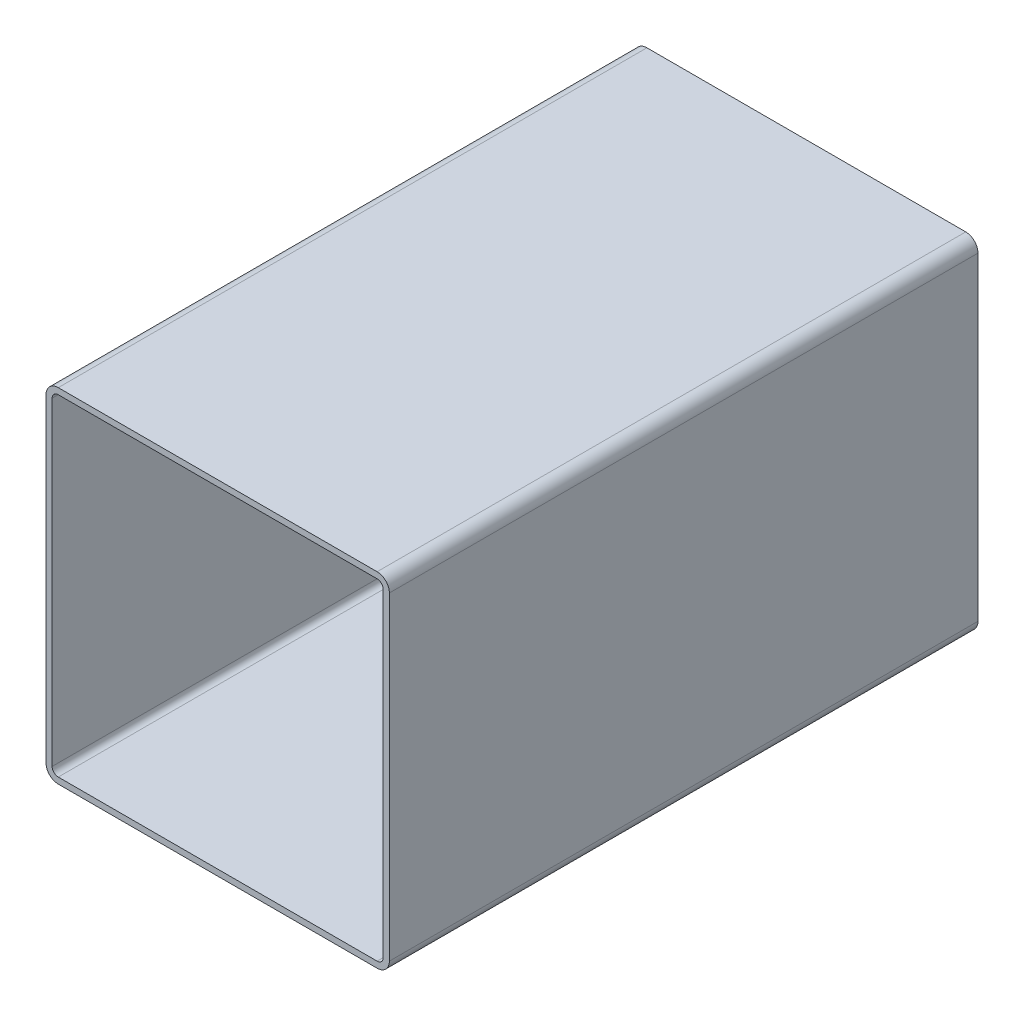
ISO-10303-21;
HEADER;
FILE_DESCRIPTION(('STEP AP214'),'2;1');
FILE_NAME('part.step','',(''),(''),'','','');
FILE_SCHEMA(('AUTOMOTIVE_DESIGN { 1 0 10303 214 1 1 1 1 }'));
ENDSEC;
DATA;
#1=APPLICATION_CONTEXT('core data for automotive mechanical design processes');
#2=APPLICATION_PROTOCOL_DEFINITION('international standard','automotive_design',2000,#1);
#3=PRODUCT_CONTEXT('',#1,'mechanical');
#4=PRODUCT('Part','Part','',(#3));
#5=PRODUCT_RELATED_PRODUCT_CATEGORY('part','',(#4));
#6=PRODUCT_DEFINITION_FORMATION('','',#4);
#7=PRODUCT_DEFINITION_CONTEXT('part definition',#1,'design');
#8=PRODUCT_DEFINITION('design','',#6,#7);
#9=PRODUCT_DEFINITION_SHAPE('','',#8);
#10=(LENGTH_UNIT() NAMED_UNIT(*) SI_UNIT(.MILLI.,.METRE.));
#11=(NAMED_UNIT(*) PLANE_ANGLE_UNIT() SI_UNIT($,.RADIAN.));
#12=(NAMED_UNIT(*) SI_UNIT($,.STERADIAN.) SOLID_ANGLE_UNIT());
#13=UNCERTAINTY_MEASURE_WITH_UNIT(LENGTH_MEASURE(1.E-05),#10,'distance_accuracy_value','');
#14=(GEOMETRIC_REPRESENTATION_CONTEXT(3) GLOBAL_UNCERTAINTY_ASSIGNED_CONTEXT((#13)) GLOBAL_UNIT_ASSIGNED_CONTEXT((#10,
#11,#12)) REPRESENTATION_CONTEXT('',''));
#15=CARTESIAN_POINT('',(0.,0.,0.));
#16=DIRECTION('',(0.,0.,1.));
#17=DIRECTION('',(1.,0.,0.));
#18=AXIS2_PLACEMENT_3D('',#15,#16,#17);
#19=CARTESIAN_POINT('',(8.55487862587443,173.439039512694,304.8));
#20=DIRECTION('',(0.,0.,1.));
#21=DIRECTION('',(1.,0.,0.));
#22=AXIS2_PLACEMENT_3D('',#19,#20,#21);
#23=PLANE('',#22);
#24=CARTESIAN_POINT('',(8.55487862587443,173.439039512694,304.8));
#25=DIRECTION('',(0.,0.,1.));
#26=DIRECTION('',(1.,0.,0.));
#27=AXIS2_PLACEMENT_3D('',#24,#25,#26);
#28=CIRCLE('',#27,6.35);
#29=CARTESIAN_POINT('',(8.55487862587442,179.789039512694,304.8));
#30=VERTEX_POINT('',#29);
#31=CARTESIAN_POINT('',(2.20487862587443,173.439039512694,304.8));
#32=VERTEX_POINT('',#31);
#33=EDGE_CURVE('E211',#30,#32,#28,.T.);
#34=ORIENTED_EDGE('',*,*,#33,.T.);
#35=DIRECTION('',(0.,-1.,0.));
#36=VECTOR('',#35,1.);
#37=CARTESIAN_POINT('',(2.20487862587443,8.33903951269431,304.8));
#38=LINE('',#37,#36);
#39=CARTESIAN_POINT('',(2.20487862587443,8.33903951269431,304.8));
#40=VERTEX_POINT('',#39);
#41=EDGE_CURVE('E214',#32,#40,#38,.T.);
#42=ORIENTED_EDGE('',*,*,#41,.T.);
#43=CARTESIAN_POINT('',(8.55487862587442,8.33903951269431,304.8));
#44=DIRECTION('',(0.,0.,1.));
#45=DIRECTION('',(1.,0.,0.));
#46=AXIS2_PLACEMENT_3D('',#43,#44,#45);
#47=CIRCLE('',#46,6.35);
#48=CARTESIAN_POINT('',(8.55487862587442,1.98903951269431,304.8));
#49=VERTEX_POINT('',#48);
#50=EDGE_CURVE('E217',#40,#49,#47,.T.);
#51=ORIENTED_EDGE('',*,*,#50,.T.);
#52=DIRECTION('',(1.,0.,0.));
#53=VECTOR('',#52,1.);
#54=CARTESIAN_POINT('',(173.654878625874,1.98903951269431,304.8));
#55=LINE('',#54,#53);
#56=CARTESIAN_POINT('',(173.654878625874,1.9890395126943,304.8));
#57=VERTEX_POINT('',#56);
#58=EDGE_CURVE('E219',#49,#57,#55,.T.);
#59=ORIENTED_EDGE('',*,*,#58,.T.);
#60=CARTESIAN_POINT('',(173.654878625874,8.33903951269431,304.8));
#61=DIRECTION('',(0.,0.,1.));
#62=DIRECTION('',(1.,0.,0.));
#63=AXIS2_PLACEMENT_3D('',#60,#61,#62);
#64=CIRCLE('',#63,6.35000000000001);
#65=CARTESIAN_POINT('',(180.004878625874,8.33903951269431,304.8));
#66=VERTEX_POINT('',#65);
#67=EDGE_CURVE('E221',#57,#66,#64,.T.);
#68=ORIENTED_EDGE('',*,*,#67,.T.);
#69=DIRECTION('',(0.,1.,0.));
#70=VECTOR('',#69,1.);
#71=CARTESIAN_POINT('',(180.004878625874,173.439039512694,304.8));
#72=LINE('',#71,#70);
#73=CARTESIAN_POINT('',(180.004878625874,173.439039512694,304.8));
#74=VERTEX_POINT('',#73);
#75=EDGE_CURVE('E223',#66,#74,#72,.T.);
#76=ORIENTED_EDGE('',*,*,#75,.T.);
#77=CARTESIAN_POINT('',(173.654878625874,173.439039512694,304.8));
#78=DIRECTION('',(0.,0.,1.));
#79=DIRECTION('',(1.,0.,0.));
#80=AXIS2_PLACEMENT_3D('',#77,#78,#79);
#81=CIRCLE('',#80,6.35000000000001);
#82=CARTESIAN_POINT('',(173.654878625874,179.789039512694,304.8));
#83=VERTEX_POINT('',#82);
#84=EDGE_CURVE('E225',#74,#83,#81,.T.);
#85=ORIENTED_EDGE('',*,*,#84,.T.);
#86=DIRECTION('',(-1.,0.,0.));
#87=VECTOR('',#86,1.);
#88=CARTESIAN_POINT('',(8.55487862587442,179.789039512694,304.8));
#89=LINE('',#88,#87);
#90=EDGE_CURVE('E227',#83,#30,#89,.T.);
#91=ORIENTED_EDGE('',*,*,#90,.T.);
#92=EDGE_LOOP('',(#34,#42,#51,#59,#68,#76,#85,#91));
#93=FACE_BOUND('',#92,.T.);
#94=DIRECTION('',(0.,-1.,0.));
#95=VECTOR('',#94,1.);
#96=CARTESIAN_POINT('',(5.37987862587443,8.33903951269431,304.8));
#97=LINE('',#96,#95);
#98=CARTESIAN_POINT('',(5.37987862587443,173.439039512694,304.8));
#99=VERTEX_POINT('',#98);
#100=CARTESIAN_POINT('',(5.37987862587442,8.33903951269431,304.8));
#101=VERTEX_POINT('',#100);
#102=EDGE_CURVE('E154',#99,#101,#97,.T.);
#103=ORIENTED_EDGE('',*,*,#102,.F.);
#104=CARTESIAN_POINT('',(8.55487862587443,173.439039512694,304.8));
#105=DIRECTION('',(0.,0.,1.));
#106=DIRECTION('',(1.,0.,0.));
#107=AXIS2_PLACEMENT_3D('',#104,#105,#106);
#108=CIRCLE('',#107,3.17500000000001);
#109=CARTESIAN_POINT('',(8.55487862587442,176.614039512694,304.8));
#110=VERTEX_POINT('',#109);
#111=EDGE_CURVE('E146',#110,#99,#108,.T.);
#112=ORIENTED_EDGE('',*,*,#111,.F.);
#113=DIRECTION('',(-1.,0.,0.));
#114=VECTOR('',#113,1.);
#115=CARTESIAN_POINT('',(8.55487862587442,176.614039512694,304.8));
#116=LINE('',#115,#114);
#117=CARTESIAN_POINT('',(173.654878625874,176.614039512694,304.8));
#118=VERTEX_POINT('',#117);
#119=EDGE_CURVE('E179',#118,#110,#116,.T.);
#120=ORIENTED_EDGE('',*,*,#119,.F.);
#121=CARTESIAN_POINT('',(173.654878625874,173.439039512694,304.8));
#122=DIRECTION('',(0.,0.,1.));
#123=DIRECTION('',(1.,0.,0.));
#124=AXIS2_PLACEMENT_3D('',#121,#122,#123);
#125=CIRCLE('',#124,3.17500000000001);
#126=CARTESIAN_POINT('',(176.829878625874,173.439039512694,304.8));
#127=VERTEX_POINT('',#126);
#128=EDGE_CURVE('E177',#127,#118,#125,.T.);
#129=ORIENTED_EDGE('',*,*,#128,.F.);
#130=DIRECTION('',(0.,1.,0.));
#131=VECTOR('',#130,1.);
#132=CARTESIAN_POINT('',(176.829878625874,173.439039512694,304.8));
#133=LINE('',#132,#131);
#134=CARTESIAN_POINT('',(176.829878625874,8.33903951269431,304.8));
#135=VERTEX_POINT('',#134);
#136=EDGE_CURVE('E175',#135,#127,#133,.T.);
#137=ORIENTED_EDGE('',*,*,#136,.F.);
#138=CARTESIAN_POINT('',(173.654878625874,8.33903951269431,304.8));
#139=DIRECTION('',(0.,0.,1.));
#140=DIRECTION('',(1.,0.,0.));
#141=AXIS2_PLACEMENT_3D('',#138,#139,#140);
#142=CIRCLE('',#141,3.17500000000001);
#143=CARTESIAN_POINT('',(173.654878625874,5.1640395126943,304.8));
#144=VERTEX_POINT('',#143);
#145=EDGE_CURVE('E173',#144,#135,#142,.T.);
#146=ORIENTED_EDGE('',*,*,#145,.F.);
#147=DIRECTION('',(1.,0.,0.));
#148=VECTOR('',#147,1.);
#149=CARTESIAN_POINT('',(173.654878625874,5.16403951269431,304.8));
#150=LINE('',#149,#148);
#151=CARTESIAN_POINT('',(8.55487862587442,5.16403951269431,304.8));
#152=VERTEX_POINT('',#151);
#153=EDGE_CURVE('E169',#152,#144,#150,.T.);
#154=ORIENTED_EDGE('',*,*,#153,.F.);
#155=CARTESIAN_POINT('',(8.55487862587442,8.33903951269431,304.8));
#156=DIRECTION('',(0.,0.,1.));
#157=DIRECTION('',(1.,0.,0.));
#158=AXIS2_PLACEMENT_3D('',#155,#156,#157);
#159=CIRCLE('',#158,3.175);
#160=EDGE_CURVE('E167',#101,#152,#159,.T.);
#161=ORIENTED_EDGE('',*,*,#160,.F.);
#162=EDGE_LOOP('',(#103,#112,#120,#129,#137,#146,#154,#161));
#163=FACE_BOUND('',#162,.T.);
#164=ADVANCED_FACE('F33',(#93,#163),#23,.T.);
#165=CARTESIAN_POINT('',(8.55487862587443,173.439039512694,0.));
#166=DIRECTION('',(0.,0.,1.));
#167=DIRECTION('',(1.,0.,0.));
#168=AXIS2_PLACEMENT_3D('',#165,#166,#167);
#169=PLANE('',#168);
#170=CARTESIAN_POINT('',(8.55487862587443,173.439039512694,0.));
#171=DIRECTION('',(0.,0.,1.));
#172=DIRECTION('',(1.,0.,0.));
#173=AXIS2_PLACEMENT_3D('',#170,#171,#172);
#174=CIRCLE('',#173,6.35);
#175=CARTESIAN_POINT('',(8.55487862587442,179.789039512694,0.));
#176=VERTEX_POINT('',#175);
#177=CARTESIAN_POINT('',(2.20487862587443,173.439039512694,0.));
#178=VERTEX_POINT('',#177);
#179=EDGE_CURVE('E162',#176,#178,#174,.T.);
#180=ORIENTED_EDGE('',*,*,#179,.F.);
#181=DIRECTION('',(-1.,0.,0.));
#182=VECTOR('',#181,1.);
#183=CARTESIAN_POINT('',(8.55487862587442,179.789039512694,0.));
#184=LINE('',#183,#182);
#185=CARTESIAN_POINT('',(173.654878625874,179.789039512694,0.));
#186=VERTEX_POINT('',#185);
#187=EDGE_CURVE('E215',#186,#176,#184,.T.);
#188=ORIENTED_EDGE('',*,*,#187,.F.);
#189=CARTESIAN_POINT('',(173.654878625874,173.439039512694,0.));
#190=DIRECTION('',(0.,0.,1.));
#191=DIRECTION('',(1.,0.,0.));
#192=AXIS2_PLACEMENT_3D('',#189,#190,#191);
#193=CIRCLE('',#192,6.35000000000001);
#194=CARTESIAN_POINT('',(180.004878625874,173.439039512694,0.));
#195=VERTEX_POINT('',#194);
#196=EDGE_CURVE('E242',#195,#186,#193,.T.);
#197=ORIENTED_EDGE('',*,*,#196,.F.);
#198=DIRECTION('',(0.,1.,0.));
#199=VECTOR('',#198,1.);
#200=CARTESIAN_POINT('',(180.004878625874,173.439039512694,0.));
#201=LINE('',#200,#199);
#202=CARTESIAN_POINT('',(180.004878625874,8.33903951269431,0.));
#203=VERTEX_POINT('',#202);
#204=EDGE_CURVE('E240',#203,#195,#201,.T.);
#205=ORIENTED_EDGE('',*,*,#204,.F.);
#206=CARTESIAN_POINT('',(173.654878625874,8.33903951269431,0.));
#207=DIRECTION('',(0.,0.,1.));
#208=DIRECTION('',(1.,0.,0.));
#209=AXIS2_PLACEMENT_3D('',#206,#207,#208);
#210=CIRCLE('',#209,6.35000000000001);
#211=CARTESIAN_POINT('',(173.654878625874,1.9890395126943,0.));
#212=VERTEX_POINT('',#211);
#213=EDGE_CURVE('E238',#212,#203,#210,.T.);
#214=ORIENTED_EDGE('',*,*,#213,.F.);
#215=DIRECTION('',(1.,0.,0.));
#216=VECTOR('',#215,1.);
#217=CARTESIAN_POINT('',(173.654878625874,1.98903951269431,0.));
#218=LINE('',#217,#216);
#219=CARTESIAN_POINT('',(8.55487862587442,1.98903951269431,0.));
#220=VERTEX_POINT('',#219);
#221=EDGE_CURVE('E236',#220,#212,#218,.T.);
#222=ORIENTED_EDGE('',*,*,#221,.F.);
#223=CARTESIAN_POINT('',(8.55487862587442,8.33903951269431,0.));
#224=DIRECTION('',(0.,0.,1.));
#225=DIRECTION('',(1.,0.,0.));
#226=AXIS2_PLACEMENT_3D('',#223,#224,#225);
#227=CIRCLE('',#226,6.35);
#228=CARTESIAN_POINT('',(2.20487862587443,8.33903951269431,0.));
#229=VERTEX_POINT('',#228);
#230=EDGE_CURVE('E234',#229,#220,#227,.T.);
#231=ORIENTED_EDGE('',*,*,#230,.F.);
#232=DIRECTION('',(0.,-1.,0.));
#233=VECTOR('',#232,1.);
#234=CARTESIAN_POINT('',(2.20487862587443,8.33903951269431,0.));
#235=LINE('',#234,#233);
#236=EDGE_CURVE('E232',#178,#229,#235,.T.);
#237=ORIENTED_EDGE('',*,*,#236,.F.);
#238=EDGE_LOOP('',(#180,#188,#197,#205,#214,#222,#231,#237));
#239=FACE_BOUND('',#238,.T.);
#240=CARTESIAN_POINT('',(8.55487862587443,173.439039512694,0.));
#241=DIRECTION('',(0.,0.,1.));
#242=DIRECTION('',(1.,0.,0.));
#243=AXIS2_PLACEMENT_3D('',#240,#241,#242);
#244=CIRCLE('',#243,3.17500000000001);
#245=CARTESIAN_POINT('',(8.55487862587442,176.614039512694,0.));
#246=VERTEX_POINT('',#245);
#247=CARTESIAN_POINT('',(5.37987862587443,173.439039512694,0.));
#248=VERTEX_POINT('',#247);
#249=EDGE_CURVE('E56',#246,#248,#244,.T.);
#250=ORIENTED_EDGE('',*,*,#249,.T.);
#251=DIRECTION('',(0.,-1.,0.));
#252=VECTOR('',#251,1.);
#253=CARTESIAN_POINT('',(5.37987862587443,8.33903951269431,0.));
#254=LINE('',#253,#252);
#255=CARTESIAN_POINT('',(5.37987862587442,8.33903951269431,0.));
#256=VERTEX_POINT('',#255);
#257=EDGE_CURVE('E161',#248,#256,#254,.T.);
#258=ORIENTED_EDGE('',*,*,#257,.T.);
#259=CARTESIAN_POINT('',(8.55487862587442,8.33903951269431,0.));
#260=DIRECTION('',(0.,0.,1.));
#261=DIRECTION('',(1.,0.,0.));
#262=AXIS2_PLACEMENT_3D('',#259,#260,#261);
#263=CIRCLE('',#262,3.175);
#264=CARTESIAN_POINT('',(8.55487862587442,5.16403951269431,0.));
#265=VERTEX_POINT('',#264);
#266=EDGE_CURVE('E183',#256,#265,#263,.T.);
#267=ORIENTED_EDGE('',*,*,#266,.T.);
#268=DIRECTION('',(1.,0.,0.));
#269=VECTOR('',#268,1.);
#270=CARTESIAN_POINT('',(173.654878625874,5.16403951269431,0.));
#271=LINE('',#270,#269);
#272=CARTESIAN_POINT('',(173.654878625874,5.1640395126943,0.));
#273=VERTEX_POINT('',#272);
#274=EDGE_CURVE('E186',#265,#273,#271,.T.);
#275=ORIENTED_EDGE('',*,*,#274,.T.);
#276=CARTESIAN_POINT('',(173.654878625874,8.33903951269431,0.));
#277=DIRECTION('',(0.,0.,1.));
#278=DIRECTION('',(1.,0.,0.));
#279=AXIS2_PLACEMENT_3D('',#276,#277,#278);
#280=CIRCLE('',#279,3.17500000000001);
#281=CARTESIAN_POINT('',(176.829878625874,8.33903951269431,0.));
#282=VERTEX_POINT('',#281);
#283=EDGE_CURVE('E189',#273,#282,#280,.T.);
#284=ORIENTED_EDGE('',*,*,#283,.T.);
#285=DIRECTION('',(0.,1.,0.));
#286=VECTOR('',#285,1.);
#287=CARTESIAN_POINT('',(176.829878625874,173.439039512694,0.));
#288=LINE('',#287,#286);
#289=CARTESIAN_POINT('',(176.829878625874,173.439039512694,0.));
#290=VERTEX_POINT('',#289);
#291=EDGE_CURVE('E192',#282,#290,#288,.T.);
#292=ORIENTED_EDGE('',*,*,#291,.T.);
#293=CARTESIAN_POINT('',(173.654878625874,173.439039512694,0.));
#294=DIRECTION('',(0.,0.,1.));
#295=DIRECTION('',(1.,0.,0.));
#296=AXIS2_PLACEMENT_3D('',#293,#294,#295);
#297=CIRCLE('',#296,3.17500000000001);
#298=CARTESIAN_POINT('',(173.654878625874,176.614039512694,0.));
#299=VERTEX_POINT('',#298);
#300=EDGE_CURVE('E195',#290,#299,#297,.T.);
#301=ORIENTED_EDGE('',*,*,#300,.T.);
#302=DIRECTION('',(-1.,0.,0.));
#303=VECTOR('',#302,1.);
#304=CARTESIAN_POINT('',(8.55487862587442,176.614039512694,0.));
#305=LINE('',#304,#303);
#306=EDGE_CURVE('E155',#299,#246,#305,.T.);
#307=ORIENTED_EDGE('',*,*,#306,.T.);
#308=EDGE_LOOP('',(#250,#258,#267,#275,#284,#292,#301,#307));
#309=FACE_BOUND('',#308,.T.);
#310=ADVANCED_FACE('F272',(#239,#309),#169,.F.);
#311=CARTESIAN_POINT('',(8.55487862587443,173.439039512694,304.8));
#312=DIRECTION('',(0.,0.,-1.));
#313=DIRECTION('',(-1.,0.,0.));
#314=AXIS2_PLACEMENT_3D('',#311,#312,#313);
#315=CYLINDRICAL_SURFACE('',#314,6.35);
#316=ORIENTED_EDGE('',*,*,#179,.T.);
#317=DIRECTION('',(0.,0.,-1.));
#318=VECTOR('',#317,1.);
#319=CARTESIAN_POINT('',(2.20487862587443,173.439039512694,304.8));
#320=LINE('',#319,#318);
#321=EDGE_CURVE('E11',#32,#178,#320,.T.);
#322=ORIENTED_EDGE('',*,*,#321,.F.);
#323=ORIENTED_EDGE('',*,*,#33,.F.);
#324=DIRECTION('',(0.,0.,-1.));
#325=VECTOR('',#324,1.);
#326=CARTESIAN_POINT('',(8.55487862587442,179.789039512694,304.8));
#327=LINE('',#326,#325);
#328=EDGE_CURVE('E229',#30,#176,#327,.T.);
#329=ORIENTED_EDGE('',*,*,#328,.T.);
#330=EDGE_LOOP('',(#316,#322,#323,#329));
#331=FACE_BOUND('',#330,.T.);
#332=ADVANCED_FACE('F35',(#331),#315,.T.);
#333=CARTESIAN_POINT('',(2.20487862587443,8.33903951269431,304.8));
#334=DIRECTION('',(1.,0.,0.));
#335=DIRECTION('',(0.,0.,-1.));
#336=AXIS2_PLACEMENT_3D('',#333,#334,#335);
#337=PLANE('',#336);
#338=ORIENTED_EDGE('',*,*,#236,.T.);
#339=DIRECTION('',(0.,0.,-1.));
#340=VECTOR('',#339,1.);
#341=CARTESIAN_POINT('',(2.20487862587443,8.33903951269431,304.8));
#342=LINE('',#341,#340);
#343=EDGE_CURVE('E41',#40,#229,#342,.T.);
#344=ORIENTED_EDGE('',*,*,#343,.F.);
#345=ORIENTED_EDGE('',*,*,#41,.F.);
#346=ORIENTED_EDGE('',*,*,#321,.T.);
#347=EDGE_LOOP('',(#338,#344,#345,#346));
#348=FACE_BOUND('',#347,.T.);
#349=ADVANCED_FACE('F289',(#348),#337,.F.);
#350=CARTESIAN_POINT('',(8.55487862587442,8.33903951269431,304.8));
#351=DIRECTION('',(0.,0.,-1.));
#352=DIRECTION('',(-1.,0.,0.));
#353=AXIS2_PLACEMENT_3D('',#350,#351,#352);
#354=CYLINDRICAL_SURFACE('',#353,6.35);
#355=ORIENTED_EDGE('',*,*,#230,.T.);
#356=DIRECTION('',(0.,0.,-1.));
#357=VECTOR('',#356,1.);
#358=CARTESIAN_POINT('',(8.55487862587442,1.98903951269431,304.8));
#359=LINE('',#358,#357);
#360=EDGE_CURVE('E259',#49,#220,#359,.T.);
#361=ORIENTED_EDGE('',*,*,#360,.F.);
#362=ORIENTED_EDGE('',*,*,#50,.F.);
#363=ORIENTED_EDGE('',*,*,#343,.T.);
#364=EDGE_LOOP('',(#355,#361,#362,#363));
#365=FACE_BOUND('',#364,.T.);
#366=ADVANCED_FACE('F266',(#365),#354,.T.);
#367=CARTESIAN_POINT('',(173.654878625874,1.98903951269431,304.8));
#368=DIRECTION('',(0.,1.,0.));
#369=DIRECTION('',(0.,0.,1.));
#370=AXIS2_PLACEMENT_3D('',#367,#368,#369);
#371=PLANE('',#370);
#372=ORIENTED_EDGE('',*,*,#221,.T.);
#373=DIRECTION('',(0.,0.,-1.));
#374=VECTOR('',#373,1.);
#375=CARTESIAN_POINT('',(173.654878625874,1.9890395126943,304.8));
#376=LINE('',#375,#374);
#377=EDGE_CURVE('E256',#57,#212,#376,.T.);
#378=ORIENTED_EDGE('',*,*,#377,.F.);
#379=ORIENTED_EDGE('',*,*,#58,.F.);
#380=ORIENTED_EDGE('',*,*,#360,.T.);
#381=EDGE_LOOP('',(#372,#378,#379,#380));
#382=FACE_BOUND('',#381,.T.);
#383=ADVANCED_FACE('F278',(#382),#371,.F.);
#384=CARTESIAN_POINT('',(173.654878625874,8.33903951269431,304.8));
#385=DIRECTION('',(0.,0.,-1.));
#386=DIRECTION('',(-1.,0.,0.));
#387=AXIS2_PLACEMENT_3D('',#384,#385,#386);
#388=CYLINDRICAL_SURFACE('',#387,6.35000000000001);
#389=ORIENTED_EDGE('',*,*,#213,.T.);
#390=DIRECTION('',(0.,0.,-1.));
#391=VECTOR('',#390,1.);
#392=CARTESIAN_POINT('',(180.004878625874,8.33903951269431,304.8));
#393=LINE('',#392,#391);
#394=EDGE_CURVE('E253',#66,#203,#393,.T.);
#395=ORIENTED_EDGE('',*,*,#394,.F.);
#396=ORIENTED_EDGE('',*,*,#67,.F.);
#397=ORIENTED_EDGE('',*,*,#377,.T.);
#398=EDGE_LOOP('',(#389,#395,#396,#397));
#399=FACE_BOUND('',#398,.T.);
#400=ADVANCED_FACE('F282',(#399),#388,.T.);
#401=CARTESIAN_POINT('',(180.004878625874,173.439039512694,304.8));
#402=DIRECTION('',(-1.,0.,0.));
#403=DIRECTION('',(0.,0.,1.));
#404=AXIS2_PLACEMENT_3D('',#401,#402,#403);
#405=PLANE('',#404);
#406=ORIENTED_EDGE('',*,*,#204,.T.);
#407=DIRECTION('',(0.,0.,-1.));
#408=VECTOR('',#407,1.);
#409=CARTESIAN_POINT('',(180.004878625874,173.439039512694,304.8));
#410=LINE('',#409,#408);
#411=EDGE_CURVE('E250',#74,#195,#410,.T.);
#412=ORIENTED_EDGE('',*,*,#411,.F.);
#413=ORIENTED_EDGE('',*,*,#75,.F.);
#414=ORIENTED_EDGE('',*,*,#394,.T.);
#415=EDGE_LOOP('',(#406,#412,#413,#414));
#416=FACE_BOUND('',#415,.T.);
#417=ADVANCED_FACE('F302',(#416),#405,.F.);
#418=CARTESIAN_POINT('',(173.654878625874,173.439039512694,304.8));
#419=DIRECTION('',(0.,0.,-1.));
#420=DIRECTION('',(-1.,0.,0.));
#421=AXIS2_PLACEMENT_3D('',#418,#419,#420);
#422=CYLINDRICAL_SURFACE('',#421,6.35000000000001);
#423=ORIENTED_EDGE('',*,*,#196,.T.);
#424=DIRECTION('',(0.,0.,-1.));
#425=VECTOR('',#424,1.);
#426=CARTESIAN_POINT('',(173.654878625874,179.789039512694,304.8));
#427=LINE('',#426,#425);
#428=EDGE_CURVE('E247',#83,#186,#427,.T.);
#429=ORIENTED_EDGE('',*,*,#428,.F.);
#430=ORIENTED_EDGE('',*,*,#84,.F.);
#431=ORIENTED_EDGE('',*,*,#411,.T.);
#432=EDGE_LOOP('',(#423,#429,#430,#431));
#433=FACE_BOUND('',#432,.T.);
#434=ADVANCED_FACE('F300',(#433),#422,.T.);
#435=CARTESIAN_POINT('',(8.55487862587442,179.789039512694,304.8));
#436=DIRECTION('',(0.,-1.,0.));
#437=DIRECTION('',(0.,0.,-1.));
#438=AXIS2_PLACEMENT_3D('',#435,#436,#437);
#439=PLANE('',#438);
#440=ORIENTED_EDGE('',*,*,#187,.T.);
#441=ORIENTED_EDGE('',*,*,#328,.F.);
#442=ORIENTED_EDGE('',*,*,#90,.F.);
#443=ORIENTED_EDGE('',*,*,#428,.T.);
#444=EDGE_LOOP('',(#440,#441,#442,#443));
#445=FACE_BOUND('',#444,.T.);
#446=ADVANCED_FACE('F295',(#445),#439,.F.);
#447=CARTESIAN_POINT('',(8.55487862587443,173.439039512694,304.8));
#448=DIRECTION('',(0.,0.,-1.));
#449=DIRECTION('',(-1.,0.,0.));
#450=AXIS2_PLACEMENT_3D('',#447,#448,#449);
#451=CYLINDRICAL_SURFACE('',#450,3.17500000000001);
#452=ORIENTED_EDGE('',*,*,#249,.F.);
#453=DIRECTION('',(0.,0.,-1.));
#454=VECTOR('',#453,1.);
#455=CARTESIAN_POINT('',(8.55487862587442,176.614039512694,304.8));
#456=LINE('',#455,#454);
#457=EDGE_CURVE('E150',#110,#246,#456,.T.);
#458=ORIENTED_EDGE('',*,*,#457,.F.);
#459=ORIENTED_EDGE('',*,*,#111,.T.);
#460=DIRECTION('',(0.,0.,-1.));
#461=VECTOR('',#460,1.);
#462=CARTESIAN_POINT('',(5.37987862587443,173.439039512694,304.8));
#463=LINE('',#462,#461);
#464=EDGE_CURVE('E149',#99,#248,#463,.T.);
#465=ORIENTED_EDGE('',*,*,#464,.T.);
#466=EDGE_LOOP('',(#452,#458,#459,#465));
#467=FACE_BOUND('',#466,.T.);
#468=ADVANCED_FACE('F148',(#467),#451,.F.);
#469=CARTESIAN_POINT('',(5.37987862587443,8.33903951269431,304.8));
#470=DIRECTION('',(1.,0.,0.));
#471=DIRECTION('',(0.,0.,-1.));
#472=AXIS2_PLACEMENT_3D('',#469,#470,#471);
#473=PLANE('',#472);
#474=ORIENTED_EDGE('',*,*,#257,.F.);
#475=ORIENTED_EDGE('',*,*,#464,.F.);
#476=ORIENTED_EDGE('',*,*,#102,.T.);
#477=DIRECTION('',(0.,0.,-1.));
#478=VECTOR('',#477,1.);
#479=CARTESIAN_POINT('',(5.37987862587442,8.33903951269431,304.8));
#480=LINE('',#479,#478);
#481=EDGE_CURVE('E163',#101,#256,#480,.T.);
#482=ORIENTED_EDGE('',*,*,#481,.T.);
#483=EDGE_LOOP('',(#474,#475,#476,#482));
#484=FACE_BOUND('',#483,.T.);
#485=ADVANCED_FACE('F158',(#484),#473,.T.);
#486=CARTESIAN_POINT('',(8.55487862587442,8.33903951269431,304.8));
#487=DIRECTION('',(0.,0.,-1.));
#488=DIRECTION('',(-1.,0.,0.));
#489=AXIS2_PLACEMENT_3D('',#486,#487,#488);
#490=CYLINDRICAL_SURFACE('',#489,3.175);
#491=ORIENTED_EDGE('',*,*,#266,.F.);
#492=ORIENTED_EDGE('',*,*,#481,.F.);
#493=ORIENTED_EDGE('',*,*,#160,.T.);
#494=DIRECTION('',(0.,0.,-1.));
#495=VECTOR('',#494,1.);
#496=CARTESIAN_POINT('',(8.55487862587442,5.16403951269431,304.8));
#497=LINE('',#496,#495);
#498=EDGE_CURVE('E208',#152,#265,#497,.T.);
#499=ORIENTED_EDGE('',*,*,#498,.T.);
#500=EDGE_LOOP('',(#491,#492,#493,#499));
#501=FACE_BOUND('',#500,.T.);
#502=ADVANCED_FACE('F327',(#501),#490,.F.);
#503=CARTESIAN_POINT('',(173.654878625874,5.16403951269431,304.8));
#504=DIRECTION('',(0.,1.,0.));
#505=DIRECTION('',(0.,0.,1.));
#506=AXIS2_PLACEMENT_3D('',#503,#504,#505);
#507=PLANE('',#506);
#508=ORIENTED_EDGE('',*,*,#274,.F.);
#509=ORIENTED_EDGE('',*,*,#498,.F.);
#510=ORIENTED_EDGE('',*,*,#153,.T.);
#511=DIRECTION('',(0.,0.,-1.));
#512=VECTOR('',#511,1.);
#513=CARTESIAN_POINT('',(173.654878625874,5.1640395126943,304.8));
#514=LINE('',#513,#512);
#515=EDGE_CURVE('E206',#144,#273,#514,.T.);
#516=ORIENTED_EDGE('',*,*,#515,.T.);
#517=EDGE_LOOP('',(#508,#509,#510,#516));
#518=FACE_BOUND('',#517,.T.);
#519=ADVANCED_FACE('F331',(#518),#507,.T.);
#520=CARTESIAN_POINT('',(173.654878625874,8.33903951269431,304.8));
#521=DIRECTION('',(0.,0.,-1.));
#522=DIRECTION('',(-1.,0.,0.));
#523=AXIS2_PLACEMENT_3D('',#520,#521,#522);
#524=CYLINDRICAL_SURFACE('',#523,3.17500000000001);
#525=ORIENTED_EDGE('',*,*,#283,.F.);
#526=ORIENTED_EDGE('',*,*,#515,.F.);
#527=ORIENTED_EDGE('',*,*,#145,.T.);
#528=DIRECTION('',(0.,0.,-1.));
#529=VECTOR('',#528,1.);
#530=CARTESIAN_POINT('',(176.829878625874,8.33903951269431,304.8));
#531=LINE('',#530,#529);
#532=EDGE_CURVE('E204',#135,#282,#531,.T.);
#533=ORIENTED_EDGE('',*,*,#532,.T.);
#534=EDGE_LOOP('',(#525,#526,#527,#533));
#535=FACE_BOUND('',#534,.T.);
#536=ADVANCED_FACE('F337',(#535),#524,.F.);
#537=CARTESIAN_POINT('',(176.829878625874,173.439039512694,304.8));
#538=DIRECTION('',(-1.,0.,0.));
#539=DIRECTION('',(0.,0.,1.));
#540=AXIS2_PLACEMENT_3D('',#537,#538,#539);
#541=PLANE('',#540);
#542=ORIENTED_EDGE('',*,*,#291,.F.);
#543=ORIENTED_EDGE('',*,*,#532,.F.);
#544=ORIENTED_EDGE('',*,*,#136,.T.);
#545=DIRECTION('',(0.,0.,-1.));
#546=VECTOR('',#545,1.);
#547=CARTESIAN_POINT('',(176.829878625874,173.439039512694,304.8));
#548=LINE('',#547,#546);
#549=EDGE_CURVE('E202',#127,#290,#548,.T.);
#550=ORIENTED_EDGE('',*,*,#549,.T.);
#551=EDGE_LOOP('',(#542,#543,#544,#550));
#552=FACE_BOUND('',#551,.T.);
#553=ADVANCED_FACE('F341',(#552),#541,.T.);
#554=CARTESIAN_POINT('',(173.654878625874,173.439039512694,304.8));
#555=DIRECTION('',(0.,0.,-1.));
#556=DIRECTION('',(-1.,0.,0.));
#557=AXIS2_PLACEMENT_3D('',#554,#555,#556);
#558=CYLINDRICAL_SURFACE('',#557,3.17500000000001);
#559=ORIENTED_EDGE('',*,*,#300,.F.);
#560=ORIENTED_EDGE('',*,*,#549,.F.);
#561=ORIENTED_EDGE('',*,*,#128,.T.);
#562=DIRECTION('',(0.,0.,-1.));
#563=VECTOR('',#562,1.);
#564=CARTESIAN_POINT('',(173.654878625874,176.614039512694,304.8));
#565=LINE('',#564,#563);
#566=EDGE_CURVE('E48',#118,#299,#565,.T.);
#567=ORIENTED_EDGE('',*,*,#566,.T.);
#568=EDGE_LOOP('',(#559,#560,#561,#567));
#569=FACE_BOUND('',#568,.T.);
#570=ADVANCED_FACE('F345',(#569),#558,.F.);
#571=CARTESIAN_POINT('',(8.55487862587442,176.614039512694,304.8));
#572=DIRECTION('',(0.,-1.,0.));
#573=DIRECTION('',(0.,0.,-1.));
#574=AXIS2_PLACEMENT_3D('',#571,#572,#573);
#575=PLANE('',#574);
#576=ORIENTED_EDGE('',*,*,#306,.F.);
#577=ORIENTED_EDGE('',*,*,#566,.F.);
#578=ORIENTED_EDGE('',*,*,#119,.T.);
#579=ORIENTED_EDGE('',*,*,#457,.T.);
#580=EDGE_LOOP('',(#576,#577,#578,#579));
#581=FACE_BOUND('',#580,.T.);
#582=ADVANCED_FACE('F349',(#581),#575,.T.);
#583=CLOSED_SHELL('',(#164,#310,#332,#349,#366,#383,#400,#417,#434,#446,#468,#485,#502,#519,
#536,#553,#570,#582));
#584=MANIFOLD_SOLID_BREP('B2',#583);
#585=ADVANCED_BREP_SHAPE_REPRESENTATION('',(#18,#584),#14);
#586=SHAPE_DEFINITION_REPRESENTATION(#9,#585);
ENDSEC;
END-ISO-10303-21;
